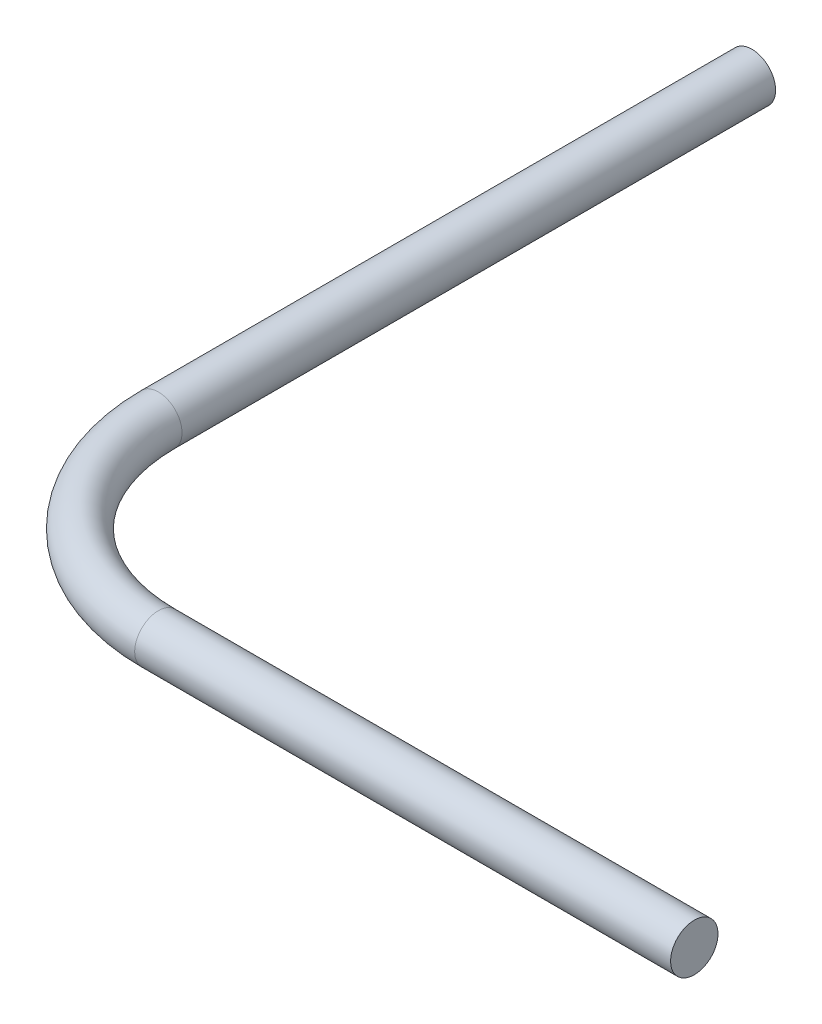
ISO-10303-21;
HEADER;
FILE_DESCRIPTION(('STEP AP214'),'2;1');
FILE_NAME('part.step','',(''),(''),'','','');
FILE_SCHEMA(('AUTOMOTIVE_DESIGN { 1 0 10303 214 1 1 1 1 }'));
ENDSEC;
DATA;
#1=APPLICATION_CONTEXT('core data for automotive mechanical design processes');
#2=APPLICATION_PROTOCOL_DEFINITION('international standard','automotive_design',2000,#1);
#3=PRODUCT_CONTEXT('',#1,'mechanical');
#4=PRODUCT('Part','Part','',(#3));
#5=PRODUCT_RELATED_PRODUCT_CATEGORY('part','',(#4));
#6=PRODUCT_DEFINITION_FORMATION('','',#4);
#7=PRODUCT_DEFINITION_CONTEXT('part definition',#1,'design');
#8=PRODUCT_DEFINITION('design','',#6,#7);
#9=PRODUCT_DEFINITION_SHAPE('','',#8);
#10=(LENGTH_UNIT() NAMED_UNIT(*) SI_UNIT(.MILLI.,.METRE.));
#11=(NAMED_UNIT(*) PLANE_ANGLE_UNIT() SI_UNIT($,.RADIAN.));
#12=(NAMED_UNIT(*) SI_UNIT($,.STERADIAN.) SOLID_ANGLE_UNIT());
#13=UNCERTAINTY_MEASURE_WITH_UNIT(LENGTH_MEASURE(1.E-05),#10,'distance_accuracy_value','');
#14=(GEOMETRIC_REPRESENTATION_CONTEXT(3) GLOBAL_UNCERTAINTY_ASSIGNED_CONTEXT((#13)) GLOBAL_UNIT_ASSIGNED_CONTEXT((#10,
#11,#12)) REPRESENTATION_CONTEXT('',''));
#15=CARTESIAN_POINT('',(0.,0.,0.));
#16=DIRECTION('',(0.,0.,1.));
#17=DIRECTION('',(1.,0.,0.));
#18=AXIS2_PLACEMENT_3D('',#15,#16,#17);
#19=CARTESIAN_POINT('',(-4.25,-8.25,8.26583154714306));
#20=DIRECTION('',(1.,0.,0.));
#21=DIRECTION('',(0.,0.,-1.));
#22=AXIS2_PLACEMENT_3D('',#19,#20,#21);
#23=CYLINDRICAL_SURFACE('',#22,0.25);
#24=CARTESIAN_POINT('',(-4.25,-8.25,8.26583154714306));
#25=DIRECTION('',(1.,0.,0.));
#26=DIRECTION('',(0.,0.,-1.));
#27=AXIS2_PLACEMENT_3D('',#24,#25,#26);
#28=CIRCLE('',#27,0.25);
#29=CARTESIAN_POINT('',(-4.25,-8.25,8.51583154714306));
#30=VERTEX_POINT('',#29);
#31=EDGE_CURVE('E35',#30,#30,#28,.T.);
#32=ORIENTED_EDGE('',*,*,#31,.T.);
#33=EDGE_LOOP('',(#32));
#34=FACE_BOUND('',#33,.T.);
#35=CARTESIAN_POINT('',(1.40734255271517,-8.25,8.26583154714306));
#36=DIRECTION('',(1.,0.,0.));
#37=DIRECTION('',(0.,0.,-1.));
#38=AXIS2_PLACEMENT_3D('',#35,#36,#37);
#39=CIRCLE('',#38,0.25);
#40=CARTESIAN_POINT('',(1.40734255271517,-8.25,8.01583154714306));
#41=VERTEX_POINT('',#40);
#42=EDGE_CURVE('E10',#41,#41,#39,.T.);
#43=ORIENTED_EDGE('',*,*,#42,.F.);
#44=EDGE_LOOP('',(#43));
#45=FACE_BOUND('',#44,.T.);
#46=ADVANCED_FACE('F29',(#34,#45),#23,.T.);
#47=CARTESIAN_POINT('',(-4.25,-8.25,6.26583154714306));
#48=DIRECTION('',(0.,1.,0.));
#49=DIRECTION('',(0.,0.,1.));
#50=AXIS2_PLACEMENT_3D('',#47,#48,#49);
#51=TOROIDAL_SURFACE('',#50,2.,0.25);
#52=CARTESIAN_POINT('',(-6.25,-8.25,6.26583154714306));
#53=DIRECTION('',(0.,0.,1.));
#54=DIRECTION('',(1.,0.,0.));
#55=AXIS2_PLACEMENT_3D('',#52,#53,#54);
#56=CIRCLE('',#55,0.25);
#57=CARTESIAN_POINT('',(-6.5,-8.25,6.26583154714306));
#58=VERTEX_POINT('',#57);
#59=EDGE_CURVE('E39',#58,#58,#56,.T.);
#60=CARTESIAN_POINT('',(-4.25,-8.25,6.26583154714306));
#61=DIRECTION('',(0.,1.,0.));
#62=DIRECTION('',(0.,0.,1.));
#63=AXIS2_PLACEMENT_3D('',#60,#61,#62);
#64=CIRCLE('',#63,2.25);
#65=EDGE_CURVE('',#58,#30,#64,.T.);
#66=ORIENTED_EDGE('',*,*,#59,.T.);
#67=ORIENTED_EDGE('',*,*,#31,.F.);
#68=ORIENTED_EDGE('',*,*,#65,.T.);
#69=ORIENTED_EDGE('',*,*,#65,.F.);
#70=EDGE_LOOP('',(#66,#68,#67,#69));
#71=FACE_BOUND('',#70,.T.);
#72=ADVANCED_FACE('F60',(#71),#51,.T.);
#73=CARTESIAN_POINT('',(-6.25,-8.25,6.26583154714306));
#74=DIRECTION('',(0.,0.,-1.));
#75=DIRECTION('',(-1.,0.,0.));
#76=AXIS2_PLACEMENT_3D('',#73,#74,#75);
#77=CYLINDRICAL_SURFACE('',#76,0.25);
#78=ORIENTED_EDGE('',*,*,#59,.F.);
#79=EDGE_LOOP('',(#78));
#80=FACE_BOUND('',#79,.T.);
#81=CARTESIAN_POINT('',(-6.25,-8.25,0.));
#82=DIRECTION('',(0.,0.,1.));
#83=DIRECTION('',(1.,0.,0.));
#84=AXIS2_PLACEMENT_3D('',#81,#82,#83);
#85=CIRCLE('',#84,0.25);
#86=CARTESIAN_POINT('',(-6.,-8.25,0.));
#87=VERTEX_POINT('',#86);
#88=EDGE_CURVE('E43',#87,#87,#85,.T.);
#89=ORIENTED_EDGE('',*,*,#88,.T.);
#90=EDGE_LOOP('',(#89));
#91=FACE_BOUND('',#90,.T.);
#92=ADVANCED_FACE('F49',(#80,#91),#77,.T.);
#93=CARTESIAN_POINT('',(1.40734255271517,-8.25,8.26583154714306));
#94=DIRECTION('',(1.,0.,0.));
#95=DIRECTION('',(0.,0.,-1.));
#96=AXIS2_PLACEMENT_3D('',#93,#94,#95);
#97=PLANE('',#96);
#98=ORIENTED_EDGE('',*,*,#42,.T.);
#99=EDGE_LOOP('',(#98));
#100=FACE_BOUND('',#99,.T.);
#101=ADVANCED_FACE('F53',(#100),#97,.T.);
#102=CARTESIAN_POINT('',(-6.25,-8.25,0.));
#103=DIRECTION('',(0.,0.,1.));
#104=DIRECTION('',(1.,0.,0.));
#105=AXIS2_PLACEMENT_3D('',#102,#103,#104);
#106=PLANE('',#105);
#107=ORIENTED_EDGE('',*,*,#88,.F.);
#108=EDGE_LOOP('',(#107));
#109=FACE_BOUND('',#108,.T.);
#110=ADVANCED_FACE('F51',(#109),#106,.F.);
#111=CLOSED_SHELL('',(#46,#72,#92,#101,#110));
#112=MANIFOLD_SOLID_BREP('B2',#111);
#113=ADVANCED_BREP_SHAPE_REPRESENTATION('',(#18,#112),#14);
#114=SHAPE_DEFINITION_REPRESENTATION(#9,#113);
ENDSEC;
END-ISO-10303-21;
